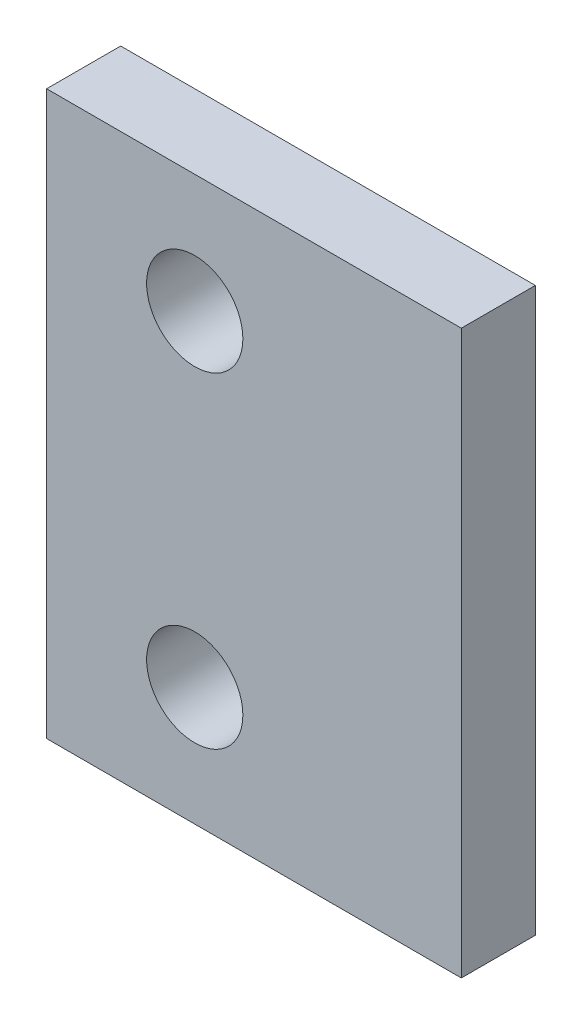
ISO-10303-21;
HEADER;
FILE_DESCRIPTION(('STEP AP214'),'2;1');
FILE_NAME('part.step','',(''),(''),'','','');
FILE_SCHEMA(('AUTOMOTIVE_DESIGN { 1 0 10303 214 1 1 1 1 }'));
ENDSEC;
DATA;
#1=APPLICATION_CONTEXT('core data for automotive mechanical design processes');
#2=APPLICATION_PROTOCOL_DEFINITION('international standard','automotive_design',2000,#1);
#3=PRODUCT_CONTEXT('',#1,'mechanical');
#4=PRODUCT('Part','Part','',(#3));
#5=PRODUCT_RELATED_PRODUCT_CATEGORY('part','',(#4));
#6=PRODUCT_DEFINITION_FORMATION('','',#4);
#7=PRODUCT_DEFINITION_CONTEXT('part definition',#1,'design');
#8=PRODUCT_DEFINITION('design','',#6,#7);
#9=PRODUCT_DEFINITION_SHAPE('','',#8);
#10=(LENGTH_UNIT() NAMED_UNIT(*) SI_UNIT(.MILLI.,.METRE.));
#11=(NAMED_UNIT(*) PLANE_ANGLE_UNIT() SI_UNIT($,.RADIAN.));
#12=(NAMED_UNIT(*) SI_UNIT($,.STERADIAN.) SOLID_ANGLE_UNIT());
#13=UNCERTAINTY_MEASURE_WITH_UNIT(LENGTH_MEASURE(1.E-05),#10,'distance_accuracy_value','');
#14=(GEOMETRIC_REPRESENTATION_CONTEXT(3) GLOBAL_UNCERTAINTY_ASSIGNED_CONTEXT((#13)) GLOBAL_UNIT_ASSIGNED_CONTEXT((#10,
#11,#12)) REPRESENTATION_CONTEXT('',''));
#15=CARTESIAN_POINT('',(0.,0.,0.));
#16=DIRECTION('',(0.,0.,1.));
#17=DIRECTION('',(1.,0.,0.));
#18=AXIS2_PLACEMENT_3D('',#15,#16,#17);
#19=CARTESIAN_POINT('',(0.,0.,5.));
#20=DIRECTION('',(0.,0.,-1.));
#21=DIRECTION('',(-1.,0.,0.));
#22=AXIS2_PLACEMENT_3D('',#19,#20,#21);
#23=PLANE('',#22);
#24=CARTESIAN_POINT('',(10.,-8.,5.));
#25=DIRECTION('',(0.,0.,1.));
#26=DIRECTION('',(1.,0.,0.));
#27=AXIS2_PLACEMENT_3D('',#24,#25,#26);
#28=CIRCLE('',#27,3.25);
#29=CARTESIAN_POINT('',(13.25,-8.,5.));
#30=VERTEX_POINT('',#29);
#31=EDGE_CURVE('E99',#30,#30,#28,.T.);
#32=ORIENTED_EDGE('',*,*,#31,.F.);
#33=EDGE_LOOP('',(#32));
#34=FACE_BOUND('',#33,.T.);
#35=DIRECTION('',(0.,-1.,0.));
#36=VECTOR('',#35,1.);
#37=CARTESIAN_POINT('',(0.,-38.,5.));
#38=LINE('',#37,#36);
#39=CARTESIAN_POINT('',(0.,0.,5.));
#40=VERTEX_POINT('',#39);
#41=CARTESIAN_POINT('',(0.,-38.,5.));
#42=VERTEX_POINT('',#41);
#43=EDGE_CURVE('E84',#40,#42,#38,.T.);
#44=ORIENTED_EDGE('',*,*,#43,.T.);
#45=DIRECTION('',(1.,0.,0.));
#46=VECTOR('',#45,1.);
#47=CARTESIAN_POINT('',(0.,-38.,5.));
#48=LINE('',#47,#46);
#49=CARTESIAN_POINT('',(28.,-38.,5.));
#50=VERTEX_POINT('',#49);
#51=EDGE_CURVE('E79',#42,#50,#48,.T.);
#52=ORIENTED_EDGE('',*,*,#51,.T.);
#53=DIRECTION('',(0.,1.,0.));
#54=VECTOR('',#53,1.);
#55=CARTESIAN_POINT('',(28.,-38.,5.));
#56=LINE('',#55,#54);
#57=CARTESIAN_POINT('',(28.,0.,5.));
#58=VERTEX_POINT('',#57);
#59=EDGE_CURVE('E82',#50,#58,#56,.T.);
#60=ORIENTED_EDGE('',*,*,#59,.T.);
#61=DIRECTION('',(-1.,0.,0.));
#62=VECTOR('',#61,1.);
#63=CARTESIAN_POINT('',(0.,0.,5.));
#64=LINE('',#63,#62);
#65=EDGE_CURVE('E49',#58,#40,#64,.T.);
#66=ORIENTED_EDGE('',*,*,#65,.T.);
#67=EDGE_LOOP('',(#44,#52,#60,#66));
#68=FACE_BOUND('',#67,.T.);
#69=CARTESIAN_POINT('',(9.99999999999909,-30.,5.));
#70=DIRECTION('',(0.,0.,1.));
#71=DIRECTION('',(1.,0.,0.));
#72=AXIS2_PLACEMENT_3D('',#69,#70,#71);
#73=CIRCLE('',#72,3.25);
#74=CARTESIAN_POINT('',(13.2499999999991,-30.,5.));
#75=VERTEX_POINT('',#74);
#76=EDGE_CURVE('E114',#75,#75,#73,.T.);
#77=ORIENTED_EDGE('',*,*,#76,.F.);
#78=EDGE_LOOP('',(#77));
#79=FACE_BOUND('',#78,.T.);
#80=ADVANCED_FACE('F32',(#34,#68,#79),#23,.F.);
#81=CARTESIAN_POINT('',(0.,0.,0.));
#82=DIRECTION('',(0.,0.,-1.));
#83=DIRECTION('',(-1.,0.,0.));
#84=AXIS2_PLACEMENT_3D('',#81,#82,#83);
#85=PLANE('',#84);
#86=CARTESIAN_POINT('',(10.,-8.,0.));
#87=DIRECTION('',(0.,0.,1.));
#88=DIRECTION('',(1.,0.,0.));
#89=AXIS2_PLACEMENT_3D('',#86,#87,#88);
#90=CIRCLE('',#89,3.25);
#91=CARTESIAN_POINT('',(13.25,-8.,0.));
#92=VERTEX_POINT('',#91);
#93=EDGE_CURVE('E111',#92,#92,#90,.T.);
#94=ORIENTED_EDGE('',*,*,#93,.T.);
#95=EDGE_LOOP('',(#94));
#96=FACE_BOUND('',#95,.T.);
#97=DIRECTION('',(0.,-1.,0.));
#98=VECTOR('',#97,1.);
#99=CARTESIAN_POINT('',(0.,-38.,0.));
#100=LINE('',#99,#98);
#101=CARTESIAN_POINT('',(0.,0.,0.));
#102=VERTEX_POINT('',#101);
#103=CARTESIAN_POINT('',(0.,-38.,0.));
#104=VERTEX_POINT('',#103);
#105=EDGE_CURVE('E96',#102,#104,#100,.T.);
#106=ORIENTED_EDGE('',*,*,#105,.F.);
#107=DIRECTION('',(-1.,0.,0.));
#108=VECTOR('',#107,1.);
#109=CARTESIAN_POINT('',(0.,0.,0.));
#110=LINE('',#109,#108);
#111=CARTESIAN_POINT('',(28.,0.,0.));
#112=VERTEX_POINT('',#111);
#113=EDGE_CURVE('E72',#112,#102,#110,.T.);
#114=ORIENTED_EDGE('',*,*,#113,.F.);
#115=DIRECTION('',(0.,1.,0.));
#116=VECTOR('',#115,1.);
#117=CARTESIAN_POINT('',(28.,-38.,0.));
#118=LINE('',#117,#116);
#119=CARTESIAN_POINT('',(28.,-38.,0.));
#120=VERTEX_POINT('',#119);
#121=EDGE_CURVE('E66',#120,#112,#118,.T.);
#122=ORIENTED_EDGE('',*,*,#121,.F.);
#123=DIRECTION('',(1.,0.,0.));
#124=VECTOR('',#123,1.);
#125=CARTESIAN_POINT('',(0.,-38.,0.));
#126=LINE('',#125,#124);
#127=EDGE_CURVE('E88',#104,#120,#126,.T.);
#128=ORIENTED_EDGE('',*,*,#127,.F.);
#129=EDGE_LOOP('',(#106,#114,#122,#128));
#130=FACE_BOUND('',#129,.T.);
#131=CARTESIAN_POINT('',(9.99999999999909,-30.,0.));
#132=DIRECTION('',(0.,0.,1.));
#133=DIRECTION('',(1.,0.,0.));
#134=AXIS2_PLACEMENT_3D('',#131,#132,#133);
#135=CIRCLE('',#134,3.25);
#136=CARTESIAN_POINT('',(13.2499999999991,-30.,0.));
#137=VERTEX_POINT('',#136);
#138=EDGE_CURVE('E117',#137,#137,#135,.T.);
#139=ORIENTED_EDGE('',*,*,#138,.T.);
#140=EDGE_LOOP('',(#139));
#141=FACE_BOUND('',#140,.T.);
#142=ADVANCED_FACE('F107',(#96,#130,#141),#85,.T.);
#143=CARTESIAN_POINT('',(0.,-38.,5.));
#144=DIRECTION('',(1.,0.,0.));
#145=DIRECTION('',(0.,0.,-1.));
#146=AXIS2_PLACEMENT_3D('',#143,#144,#145);
#147=PLANE('',#146);
#148=ORIENTED_EDGE('',*,*,#105,.T.);
#149=DIRECTION('',(0.,0.,-1.));
#150=VECTOR('',#149,1.);
#151=CARTESIAN_POINT('',(0.,-38.,5.));
#152=LINE('',#151,#150);
#153=EDGE_CURVE('E11',#42,#104,#152,.T.);
#154=ORIENTED_EDGE('',*,*,#153,.F.);
#155=ORIENTED_EDGE('',*,*,#43,.F.);
#156=DIRECTION('',(0.,0.,-1.));
#157=VECTOR('',#156,1.);
#158=CARTESIAN_POINT('',(0.,0.,5.));
#159=LINE('',#158,#157);
#160=EDGE_CURVE('E92',#40,#102,#159,.T.);
#161=ORIENTED_EDGE('',*,*,#160,.T.);
#162=EDGE_LOOP('',(#148,#154,#155,#161));
#163=FACE_BOUND('',#162,.T.);
#164=ADVANCED_FACE('F34',(#163),#147,.F.);
#165=CARTESIAN_POINT('',(0.,-38.,5.));
#166=DIRECTION('',(0.,1.,0.));
#167=DIRECTION('',(0.,0.,1.));
#168=AXIS2_PLACEMENT_3D('',#165,#166,#167);
#169=PLANE('',#168);
#170=ORIENTED_EDGE('',*,*,#127,.T.);
#171=DIRECTION('',(0.,0.,-1.));
#172=VECTOR('',#171,1.);
#173=CARTESIAN_POINT('',(28.,-38.,5.));
#174=LINE('',#173,#172);
#175=EDGE_CURVE('E41',#50,#120,#174,.T.);
#176=ORIENTED_EDGE('',*,*,#175,.F.);
#177=ORIENTED_EDGE('',*,*,#51,.F.);
#178=ORIENTED_EDGE('',*,*,#153,.T.);
#179=EDGE_LOOP('',(#170,#176,#177,#178));
#180=FACE_BOUND('',#179,.T.);
#181=ADVANCED_FACE('F87',(#180),#169,.F.);
#182=CARTESIAN_POINT('',(28.,-38.,5.));
#183=DIRECTION('',(-1.,0.,0.));
#184=DIRECTION('',(0.,0.,1.));
#185=AXIS2_PLACEMENT_3D('',#182,#183,#184);
#186=PLANE('',#185);
#187=ORIENTED_EDGE('',*,*,#121,.T.);
#188=DIRECTION('',(0.,0.,-1.));
#189=VECTOR('',#188,1.);
#190=CARTESIAN_POINT('',(28.,0.,5.));
#191=LINE('',#190,#189);
#192=EDGE_CURVE('E89',#58,#112,#191,.T.);
#193=ORIENTED_EDGE('',*,*,#192,.F.);
#194=ORIENTED_EDGE('',*,*,#59,.F.);
#195=ORIENTED_EDGE('',*,*,#175,.T.);
#196=EDGE_LOOP('',(#187,#193,#194,#195));
#197=FACE_BOUND('',#196,.T.);
#198=ADVANCED_FACE('F90',(#197),#186,.F.);
#199=CARTESIAN_POINT('',(0.,0.,5.));
#200=DIRECTION('',(0.,-1.,0.));
#201=DIRECTION('',(0.,0.,-1.));
#202=AXIS2_PLACEMENT_3D('',#199,#200,#201);
#203=PLANE('',#202);
#204=ORIENTED_EDGE('',*,*,#113,.T.);
#205=ORIENTED_EDGE('',*,*,#160,.F.);
#206=ORIENTED_EDGE('',*,*,#65,.F.);
#207=ORIENTED_EDGE('',*,*,#192,.T.);
#208=EDGE_LOOP('',(#204,#205,#206,#207));
#209=FACE_BOUND('',#208,.T.);
#210=ADVANCED_FACE('F104',(#209),#203,.F.);
#211=CARTESIAN_POINT('',(10.,-8.,5.));
#212=DIRECTION('',(0.,0.,-1.));
#213=DIRECTION('',(-1.,0.,0.));
#214=AXIS2_PLACEMENT_3D('',#211,#212,#213);
#215=CYLINDRICAL_SURFACE('',#214,3.25);
#216=ORIENTED_EDGE('',*,*,#31,.T.);
#217=EDGE_LOOP('',(#216));
#218=FACE_BOUND('',#217,.T.);
#219=ORIENTED_EDGE('',*,*,#93,.F.);
#220=EDGE_LOOP('',(#219));
#221=FACE_BOUND('',#220,.T.);
#222=ADVANCED_FACE('F135',(#218,#221),#215,.F.);
#223=CARTESIAN_POINT('',(9.99999999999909,-30.,5.));
#224=DIRECTION('',(0.,0.,-1.));
#225=DIRECTION('',(-1.,0.,0.));
#226=AXIS2_PLACEMENT_3D('',#223,#224,#225);
#227=CYLINDRICAL_SURFACE('',#226,3.25);
#228=ORIENTED_EDGE('',*,*,#76,.T.);
#229=EDGE_LOOP('',(#228));
#230=FACE_BOUND('',#229,.T.);
#231=ORIENTED_EDGE('',*,*,#138,.F.);
#232=EDGE_LOOP('',(#231));
#233=FACE_BOUND('',#232,.T.);
#234=ADVANCED_FACE('F123',(#230,#233),#227,.F.);
#235=CLOSED_SHELL('',(#80,#142,#164,#181,#198,#210,#222,#234));
#236=MANIFOLD_SOLID_BREP('B2',#235);
#237=ADVANCED_BREP_SHAPE_REPRESENTATION('',(#18,#236),#14);
#238=SHAPE_DEFINITION_REPRESENTATION(#9,#237);
ENDSEC;
END-ISO-10303-21;
